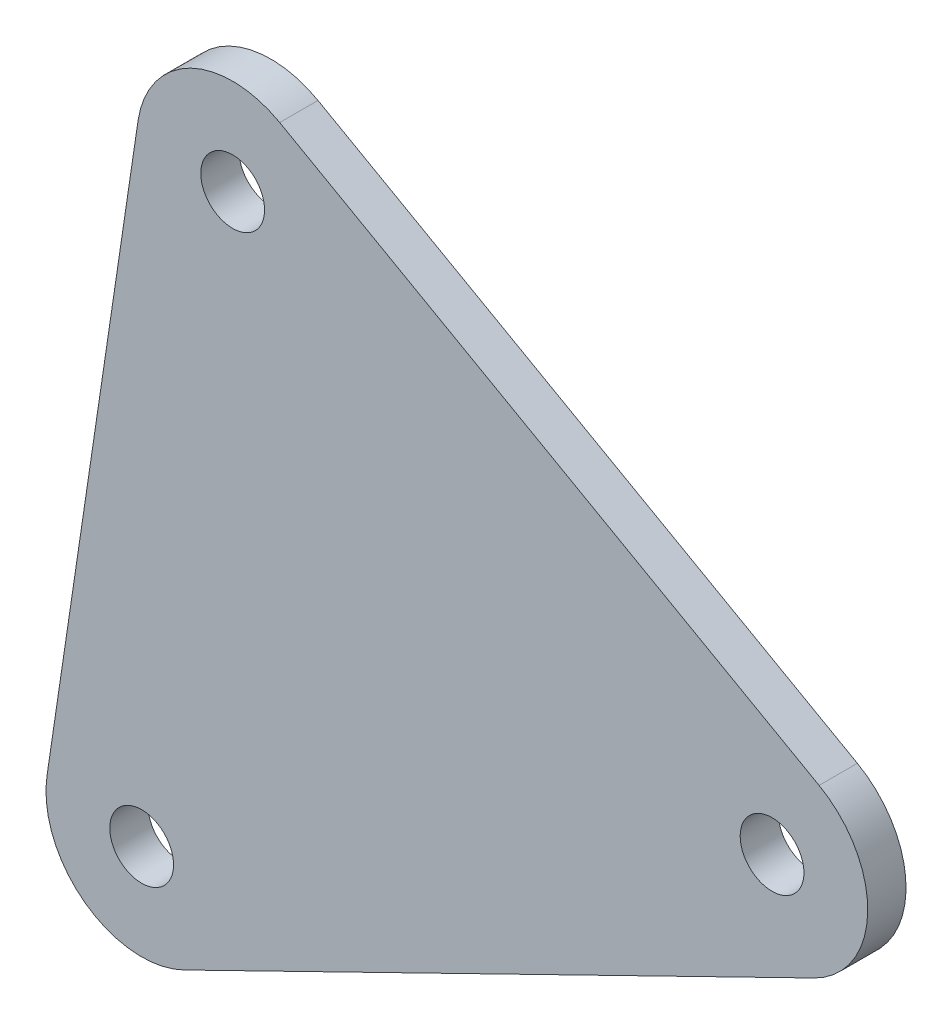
ISO-10303-21;
HEADER;
FILE_DESCRIPTION(('STEP AP214'),'2;1');
FILE_NAME('part.step','',(''),(''),'','','');
FILE_SCHEMA(('AUTOMOTIVE_DESIGN { 1 0 10303 214 1 1 1 1 }'));
ENDSEC;
DATA;
#1=APPLICATION_CONTEXT('core data for automotive mechanical design processes');
#2=APPLICATION_PROTOCOL_DEFINITION('international standard','automotive_design',2000,#1);
#3=PRODUCT_CONTEXT('',#1,'mechanical');
#4=PRODUCT('Part','Part','',(#3));
#5=PRODUCT_RELATED_PRODUCT_CATEGORY('part','',(#4));
#6=PRODUCT_DEFINITION_FORMATION('','',#4);
#7=PRODUCT_DEFINITION_CONTEXT('part definition',#1,'design');
#8=PRODUCT_DEFINITION('design','',#6,#7);
#9=PRODUCT_DEFINITION_SHAPE('','',#8);
#10=(LENGTH_UNIT() NAMED_UNIT(*) SI_UNIT(.MILLI.,.METRE.));
#11=(NAMED_UNIT(*) PLANE_ANGLE_UNIT() SI_UNIT($,.RADIAN.));
#12=(NAMED_UNIT(*) SI_UNIT($,.STERADIAN.) SOLID_ANGLE_UNIT());
#13=UNCERTAINTY_MEASURE_WITH_UNIT(LENGTH_MEASURE(1.E-05),#10,'distance_accuracy_value','');
#14=(GEOMETRIC_REPRESENTATION_CONTEXT(3) GLOBAL_UNCERTAINTY_ASSIGNED_CONTEXT((#13)) GLOBAL_UNIT_ASSIGNED_CONTEXT((#10,
#11,#12)) REPRESENTATION_CONTEXT('',''));
#15=CARTESIAN_POINT('',(0.,0.,0.));
#16=DIRECTION('',(0.,0.,1.));
#17=DIRECTION('',(1.,0.,0.));
#18=AXIS2_PLACEMENT_3D('',#15,#16,#17);
#19=CARTESIAN_POINT('',(-4.14209306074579,23.725568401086,0.));
#20=DIRECTION('',(0.,0.,1.));
#21=DIRECTION('',(1.,0.,0.));
#22=AXIS2_PLACEMENT_3D('',#19,#20,#21);
#23=PLANE('',#22);
#24=CARTESIAN_POINT('',(38.1336243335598,-0.128440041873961,0.));
#25=DIRECTION('',(0.,0.,-1.));
#26=DIRECTION('',(-1.,0.,0.));
#27=AXIS2_PLACEMENT_3D('',#24,#25,#26);
#28=CIRCLE('',#27,2.5);
#29=CARTESIAN_POINT('',(35.6336243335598,-0.128440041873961,0.));
#30=VERTEX_POINT('',#29);
#31=EDGE_CURVE('E109',#30,#30,#28,.F.);
#32=ORIENTED_EDGE('',*,*,#31,.T.);
#33=EDGE_LOOP('',(#32));
#34=FACE_BOUND('',#33,.T.);
#35=CARTESIAN_POINT('',(-11.2757512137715,-24.288605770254,0.));
#36=DIRECTION('',(0.,0.,-1.));
#37=DIRECTION('',(-1.,0.,0.));
#38=AXIS2_PLACEMENT_3D('',#35,#36,#37);
#39=CIRCLE('',#38,2.5);
#40=CARTESIAN_POINT('',(-13.7757512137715,-24.288605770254,0.));
#41=VERTEX_POINT('',#40);
#42=EDGE_CURVE('E115',#41,#41,#39,.F.);
#43=ORIENTED_EDGE('',*,*,#42,.T.);
#44=EDGE_LOOP('',(#43));
#45=FACE_BOUND('',#44,.T.);
#46=CARTESIAN_POINT('',(-4.14209306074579,23.725568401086,0.));
#47=DIRECTION('',(0.,0.,-1.));
#48=DIRECTION('',(-1.,0.,0.));
#49=AXIS2_PLACEMENT_3D('',#46,#47,#48);
#50=CIRCLE('',#49,2.5);
#51=CARTESIAN_POINT('',(-6.64209306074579,23.725568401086,0.));
#52=VERTEX_POINT('',#51);
#53=EDGE_CURVE('E112',#52,#52,#50,.F.);
#54=ORIENTED_EDGE('',*,*,#53,.T.);
#55=EDGE_LOOP('',(#54));
#56=FACE_BOUND('',#55,.T.);
#57=DIRECTION('',(0.870924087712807,-0.491417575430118,0.));
#58=VECTOR('',#57,1.);
#59=CARTESIAN_POINT('',(-0.456461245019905,30.2574990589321,0.));
#60=LINE('',#59,#58);
#61=CARTESIAN_POINT('',(-0.456461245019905,30.2574990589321,0.));
#62=VERTEX_POINT('',#61);
#63=CARTESIAN_POINT('',(41.8192561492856,6.40349061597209,0.));
#64=VERTEX_POINT('',#63);
#65=EDGE_CURVE('E118',#62,#64,#60,.T.);
#66=ORIENTED_EDGE('',*,*,#65,.T.);
#67=CARTESIAN_POINT('',(38.1336243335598,-0.128440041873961,0.));
#68=DIRECTION('',(0.,0.,-1.));
#69=DIRECTION('',(-1.,0.,0.));
#70=AXIS2_PLACEMENT_3D('',#67,#68,#69);
#71=CIRCLE('',#70,7.5);
#72=CARTESIAN_POINT('',(41.4281923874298,-6.86608216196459,0.));
#73=VERTEX_POINT('',#72);
#74=EDGE_CURVE('E119',#73,#64,#71,.F.);
#75=ORIENTED_EDGE('',*,*,#74,.F.);
#76=DIRECTION('',(-0.898352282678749,-0.439275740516,0.));
#77=VECTOR('',#76,1.);
#78=CARTESIAN_POINT('',(41.4281923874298,-6.86608216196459,0.));
#79=LINE('',#78,#77);
#80=CARTESIAN_POINT('',(-7.9811831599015,-31.0262478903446,0.));
#81=VERTEX_POINT('',#80);
#82=EDGE_CURVE('E74',#73,#81,#79,.T.);
#83=ORIENTED_EDGE('',*,*,#82,.T.);
#84=CARTESIAN_POINT('',(-11.2757512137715,-24.288605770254,0.));
#85=DIRECTION('',(0.,0.,-1.));
#86=DIRECTION('',(-1.,0.,0.));
#87=AXIS2_PLACEMENT_3D('',#84,#85,#86);
#88=CIRCLE('',#87,7.5);
#89=CARTESIAN_POINT('',(-18.694318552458,-23.1863995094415,0.));
#90=VERTEX_POINT('',#89);
#91=EDGE_CURVE('E67',#90,#81,#88,.F.);
#92=ORIENTED_EDGE('',*,*,#91,.F.);
#93=DIRECTION('',(0.146960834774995,0.989142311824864,0.));
#94=VECTOR('',#93,1.);
#95=CARTESIAN_POINT('',(-18.694318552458,-23.1863995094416,0.));
#96=LINE('',#95,#94);
#97=CARTESIAN_POINT('',(-11.5606603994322,24.8277746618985,0.));
#98=VERTEX_POINT('',#97);
#99=EDGE_CURVE('E71',#90,#98,#96,.T.);
#100=ORIENTED_EDGE('',*,*,#99,.T.);
#101=CARTESIAN_POINT('',(-4.14209306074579,23.725568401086,0.));
#102=DIRECTION('',(0.,0.,-1.));
#103=DIRECTION('',(-1.,0.,0.));
#104=AXIS2_PLACEMENT_3D('',#101,#102,#103);
#105=CIRCLE('',#104,7.5);
#106=EDGE_CURVE('E20',#62,#98,#105,.F.);
#107=ORIENTED_EDGE('',*,*,#106,.F.);
#108=EDGE_LOOP('',(#66,#75,#83,#92,#100,#107));
#109=FACE_BOUND('',#108,.T.);
#110=ADVANCED_FACE('F17',(#34,#45,#56,#109),#23,.F.);
#111=CARTESIAN_POINT('',(-4.14209306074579,23.725568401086,3.));
#112=DIRECTION('',(0.,0.,-1.));
#113=DIRECTION('',(-1.,0.,0.));
#114=AXIS2_PLACEMENT_3D('',#111,#112,#113);
#115=CYLINDRICAL_SURFACE('',#114,7.5);
#116=CARTESIAN_POINT('',(-4.14209306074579,23.725568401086,3.));
#117=DIRECTION('',(0.,0.,-1.));
#118=DIRECTION('',(-1.,0.,0.));
#119=AXIS2_PLACEMENT_3D('',#116,#117,#118);
#120=CIRCLE('',#119,7.5);
#121=CARTESIAN_POINT('',(-0.456461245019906,30.257499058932,3.));
#122=VERTEX_POINT('',#121);
#123=CARTESIAN_POINT('',(-11.5606603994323,24.8277746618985,3.));
#124=VERTEX_POINT('',#123);
#125=EDGE_CURVE('E106',#122,#124,#120,.F.);
#126=ORIENTED_EDGE('',*,*,#125,.F.);
#127=DIRECTION('',(0.,0.,1.));
#128=VECTOR('',#127,1.);
#129=CARTESIAN_POINT('',(-0.456461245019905,30.2574990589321,3.));
#130=LINE('',#129,#128);
#131=EDGE_CURVE('E127',#122,#62,#130,.F.);
#132=ORIENTED_EDGE('',*,*,#131,.T.);
#133=ORIENTED_EDGE('',*,*,#106,.T.);
#134=DIRECTION('',(0.,0.,1.));
#135=VECTOR('',#134,1.);
#136=CARTESIAN_POINT('',(-11.5606603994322,24.8277746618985,3.));
#137=LINE('',#136,#135);
#138=EDGE_CURVE('E87',#98,#124,#137,.T.);
#139=ORIENTED_EDGE('',*,*,#138,.T.);
#140=EDGE_LOOP('',(#126,#132,#133,#139));
#141=FACE_BOUND('',#140,.T.);
#142=ADVANCED_FACE('F176',(#141),#115,.T.);
#143=CARTESIAN_POINT('',(-18.694318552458,-23.1863995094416,3.));
#144=DIRECTION('',(0.989142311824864,-0.146960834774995,0.));
#145=DIRECTION('',(0.146960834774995,0.989142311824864,0.));
#146=AXIS2_PLACEMENT_3D('',#143,#144,#145);
#147=PLANE('',#146);
#148=DIRECTION('',(0.,0.,1.));
#149=VECTOR('',#148,1.);
#150=CARTESIAN_POINT('',(-18.694318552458,-23.1863995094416,3.));
#151=LINE('',#150,#149);
#152=CARTESIAN_POINT('',(-18.694318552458,-23.1863995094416,3.));
#153=VERTEX_POINT('',#152);
#154=EDGE_CURVE('E80',#153,#90,#151,.F.);
#155=ORIENTED_EDGE('',*,*,#154,.F.);
#156=DIRECTION('',(-0.146960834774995,-0.989142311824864,0.));
#157=VECTOR('',#156,1.);
#158=CARTESIAN_POINT('',(-11.5606603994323,24.8277746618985,3.));
#159=LINE('',#158,#157);
#160=EDGE_CURVE('E105',#124,#153,#159,.T.);
#161=ORIENTED_EDGE('',*,*,#160,.F.);
#162=ORIENTED_EDGE('',*,*,#138,.F.);
#163=ORIENTED_EDGE('',*,*,#99,.F.);
#164=EDGE_LOOP('',(#155,#161,#162,#163));
#165=FACE_BOUND('',#164,.T.);
#166=ADVANCED_FACE('F89',(#165),#147,.F.);
#167=CARTESIAN_POINT('',(-11.2757512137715,-24.288605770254,3.));
#168=DIRECTION('',(0.,0.,-1.));
#169=DIRECTION('',(-1.,0.,0.));
#170=AXIS2_PLACEMENT_3D('',#167,#168,#169);
#171=CYLINDRICAL_SURFACE('',#170,7.5);
#172=ORIENTED_EDGE('',*,*,#91,.T.);
#173=DIRECTION('',(0.,0.,1.));
#174=VECTOR('',#173,1.);
#175=CARTESIAN_POINT('',(-7.9811831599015,-31.0262478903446,3.));
#176=LINE('',#175,#174);
#177=CARTESIAN_POINT('',(-7.98118315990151,-31.0262478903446,3.));
#178=VERTEX_POINT('',#177);
#179=EDGE_CURVE('E77',#81,#178,#176,.T.);
#180=ORIENTED_EDGE('',*,*,#179,.T.);
#181=CARTESIAN_POINT('',(-11.2757512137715,-24.288605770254,3.));
#182=DIRECTION('',(0.,0.,-1.));
#183=DIRECTION('',(-1.,0.,0.));
#184=AXIS2_PLACEMENT_3D('',#181,#182,#183);
#185=CIRCLE('',#184,7.5);
#186=EDGE_CURVE('E83',#153,#178,#185,.F.);
#187=ORIENTED_EDGE('',*,*,#186,.F.);
#188=ORIENTED_EDGE('',*,*,#154,.T.);
#189=EDGE_LOOP('',(#172,#180,#187,#188));
#190=FACE_BOUND('',#189,.T.);
#191=ADVANCED_FACE('F81',(#190),#171,.T.);
#192=CARTESIAN_POINT('',(41.4281923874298,-6.86608216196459,3.));
#193=DIRECTION('',(-0.439275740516,0.898352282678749,0.));
#194=DIRECTION('',(-0.898352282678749,-0.439275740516,0.));
#195=AXIS2_PLACEMENT_3D('',#192,#193,#194);
#196=PLANE('',#195);
#197=DIRECTION('',(0.,0.,-1.));
#198=VECTOR('',#197,1.);
#199=CARTESIAN_POINT('',(41.4281923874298,-6.86608216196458,3.));
#200=LINE('',#199,#198);
#201=CARTESIAN_POINT('',(41.4281923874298,-6.86608216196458,3.));
#202=VERTEX_POINT('',#201);
#203=EDGE_CURVE('E120',#202,#73,#200,.T.);
#204=ORIENTED_EDGE('',*,*,#203,.F.);
#205=DIRECTION('',(0.898352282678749,0.439275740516,0.));
#206=VECTOR('',#205,1.);
#207=CARTESIAN_POINT('',(-7.98118315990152,-31.0262478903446,3.));
#208=LINE('',#207,#206);
#209=EDGE_CURVE('E103',#178,#202,#208,.T.);
#210=ORIENTED_EDGE('',*,*,#209,.F.);
#211=ORIENTED_EDGE('',*,*,#179,.F.);
#212=ORIENTED_EDGE('',*,*,#82,.F.);
#213=EDGE_LOOP('',(#204,#210,#211,#212));
#214=FACE_BOUND('',#213,.T.);
#215=ADVANCED_FACE('F154',(#214),#196,.F.);
#216=CARTESIAN_POINT('',(38.1336243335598,-0.128440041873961,3.));
#217=DIRECTION('',(0.,0.,-1.));
#218=DIRECTION('',(-1.,0.,0.));
#219=AXIS2_PLACEMENT_3D('',#216,#217,#218);
#220=CYLINDRICAL_SURFACE('',#219,7.5);
#221=CARTESIAN_POINT('',(38.1336243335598,-0.128440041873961,3.));
#222=DIRECTION('',(0.,0.,-1.));
#223=DIRECTION('',(-1.,0.,0.));
#224=AXIS2_PLACEMENT_3D('',#221,#222,#223);
#225=CIRCLE('',#224,7.5);
#226=CARTESIAN_POINT('',(41.8192561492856,6.40349061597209,3.));
#227=VERTEX_POINT('',#226);
#228=EDGE_CURVE('E100',#202,#227,#225,.F.);
#229=ORIENTED_EDGE('',*,*,#228,.F.);
#230=ORIENTED_EDGE('',*,*,#203,.T.);
#231=ORIENTED_EDGE('',*,*,#74,.T.);
#232=DIRECTION('',(0.,0.,1.));
#233=VECTOR('',#232,1.);
#234=CARTESIAN_POINT('',(41.8192561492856,6.40349061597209,3.));
#235=LINE('',#234,#233);
#236=EDGE_CURVE('E35',#64,#227,#235,.T.);
#237=ORIENTED_EDGE('',*,*,#236,.T.);
#238=EDGE_LOOP('',(#229,#230,#231,#237));
#239=FACE_BOUND('',#238,.T.);
#240=ADVANCED_FACE('F144',(#239),#220,.T.);
#241=CARTESIAN_POINT('',(-0.456461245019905,30.2574990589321,3.));
#242=DIRECTION('',(-0.491417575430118,-0.870924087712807,0.));
#243=DIRECTION('',(0.870924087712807,-0.491417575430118,0.));
#244=AXIS2_PLACEMENT_3D('',#241,#242,#243);
#245=PLANE('',#244);
#246=ORIENTED_EDGE('',*,*,#131,.F.);
#247=DIRECTION('',(-0.870924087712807,0.491417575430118,0.));
#248=VECTOR('',#247,1.);
#249=CARTESIAN_POINT('',(41.8192561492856,6.40349061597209,3.));
#250=LINE('',#249,#248);
#251=EDGE_CURVE('E99',#227,#122,#250,.T.);
#252=ORIENTED_EDGE('',*,*,#251,.F.);
#253=ORIENTED_EDGE('',*,*,#236,.F.);
#254=ORIENTED_EDGE('',*,*,#65,.F.);
#255=EDGE_LOOP('',(#246,#252,#253,#254));
#256=FACE_BOUND('',#255,.T.);
#257=ADVANCED_FACE('F141',(#256),#245,.F.);
#258=CARTESIAN_POINT('',(-11.2757512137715,-24.288605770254,3.));
#259=DIRECTION('',(0.,0.,-1.));
#260=DIRECTION('',(-1.,0.,0.));
#261=AXIS2_PLACEMENT_3D('',#258,#259,#260);
#262=CYLINDRICAL_SURFACE('',#261,2.5);
#263=CARTESIAN_POINT('',(-11.2757512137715,-24.288605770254,3.));
#264=DIRECTION('',(0.,0.,-1.));
#265=DIRECTION('',(-1.,0.,0.));
#266=AXIS2_PLACEMENT_3D('',#263,#264,#265);
#267=CIRCLE('',#266,2.5);
#268=CARTESIAN_POINT('',(-13.7757512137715,-24.288605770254,3.));
#269=VERTEX_POINT('',#268);
#270=EDGE_CURVE('E96',#269,#269,#267,.T.);
#271=ORIENTED_EDGE('',*,*,#270,.F.);
#272=EDGE_LOOP('',(#271));
#273=FACE_BOUND('',#272,.T.);
#274=ORIENTED_EDGE('',*,*,#42,.F.);
#275=EDGE_LOOP('',(#274));
#276=FACE_BOUND('',#275,.T.);
#277=ADVANCED_FACE('F143',(#273,#276),#262,.F.);
#278=CARTESIAN_POINT('',(-4.14209306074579,23.725568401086,3.));
#279=DIRECTION('',(0.,0.,-1.));
#280=DIRECTION('',(-1.,0.,0.));
#281=AXIS2_PLACEMENT_3D('',#278,#279,#280);
#282=CYLINDRICAL_SURFACE('',#281,2.5);
#283=CARTESIAN_POINT('',(-4.14209306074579,23.725568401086,3.));
#284=DIRECTION('',(0.,0.,-1.));
#285=DIRECTION('',(-1.,0.,0.));
#286=AXIS2_PLACEMENT_3D('',#283,#284,#285);
#287=CIRCLE('',#286,2.5);
#288=CARTESIAN_POINT('',(-6.64209306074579,23.725568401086,3.));
#289=VERTEX_POINT('',#288);
#290=EDGE_CURVE('E26',#289,#289,#287,.T.);
#291=ORIENTED_EDGE('',*,*,#290,.F.);
#292=EDGE_LOOP('',(#291));
#293=FACE_BOUND('',#292,.T.);
#294=ORIENTED_EDGE('',*,*,#53,.F.);
#295=EDGE_LOOP('',(#294));
#296=FACE_BOUND('',#295,.T.);
#297=ADVANCED_FACE('F151',(#293,#296),#282,.F.);
#298=CARTESIAN_POINT('',(38.1336243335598,-0.128440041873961,3.));
#299=DIRECTION('',(0.,0.,-1.));
#300=DIRECTION('',(-1.,0.,0.));
#301=AXIS2_PLACEMENT_3D('',#298,#299,#300);
#302=CYLINDRICAL_SURFACE('',#301,2.5);
#303=CARTESIAN_POINT('',(38.1336243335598,-0.128440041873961,3.));
#304=DIRECTION('',(0.,0.,-1.));
#305=DIRECTION('',(-1.,0.,0.));
#306=AXIS2_PLACEMENT_3D('',#303,#304,#305);
#307=CIRCLE('',#306,2.5);
#308=CARTESIAN_POINT('',(35.6336243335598,-0.128440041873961,3.));
#309=VERTEX_POINT('',#308);
#310=EDGE_CURVE('E11',#309,#309,#307,.T.);
#311=ORIENTED_EDGE('',*,*,#310,.F.);
#312=EDGE_LOOP('',(#311));
#313=FACE_BOUND('',#312,.T.);
#314=ORIENTED_EDGE('',*,*,#31,.F.);
#315=EDGE_LOOP('',(#314));
#316=FACE_BOUND('',#315,.T.);
#317=ADVANCED_FACE('F157',(#313,#316),#302,.F.);
#318=CARTESIAN_POINT('',(-4.14209306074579,23.725568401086,3.));
#319=DIRECTION('',(0.,0.,1.));
#320=DIRECTION('',(1.,0.,0.));
#321=AXIS2_PLACEMENT_3D('',#318,#319,#320);
#322=PLANE('',#321);
#323=ORIENTED_EDGE('',*,*,#310,.T.);
#324=EDGE_LOOP('',(#323));
#325=FACE_BOUND('',#324,.T.);
#326=ORIENTED_EDGE('',*,*,#290,.T.);
#327=EDGE_LOOP('',(#326));
#328=FACE_BOUND('',#327,.T.);
#329=ORIENTED_EDGE('',*,*,#270,.T.);
#330=EDGE_LOOP('',(#329));
#331=FACE_BOUND('',#330,.T.);
#332=ORIENTED_EDGE('',*,*,#228,.T.);
#333=ORIENTED_EDGE('',*,*,#251,.T.);
#334=ORIENTED_EDGE('',*,*,#125,.T.);
#335=ORIENTED_EDGE('',*,*,#160,.T.);
#336=ORIENTED_EDGE('',*,*,#186,.T.);
#337=ORIENTED_EDGE('',*,*,#209,.T.);
#338=EDGE_LOOP('',(#332,#333,#334,#335,#336,#337));
#339=FACE_BOUND('',#338,.T.);
#340=ADVANCED_FACE('F139',(#325,#328,#331,#339),#322,.T.);
#341=CLOSED_SHELL('',(#110,#142,#166,#191,#215,#240,#257,#277,#297,#317,#340));
#342=MANIFOLD_SOLID_BREP('B1',#341);
#343=ADVANCED_BREP_SHAPE_REPRESENTATION('',(#18,#342),#14);
#344=SHAPE_DEFINITION_REPRESENTATION(#9,#343);
ENDSEC;
END-ISO-10303-21;
